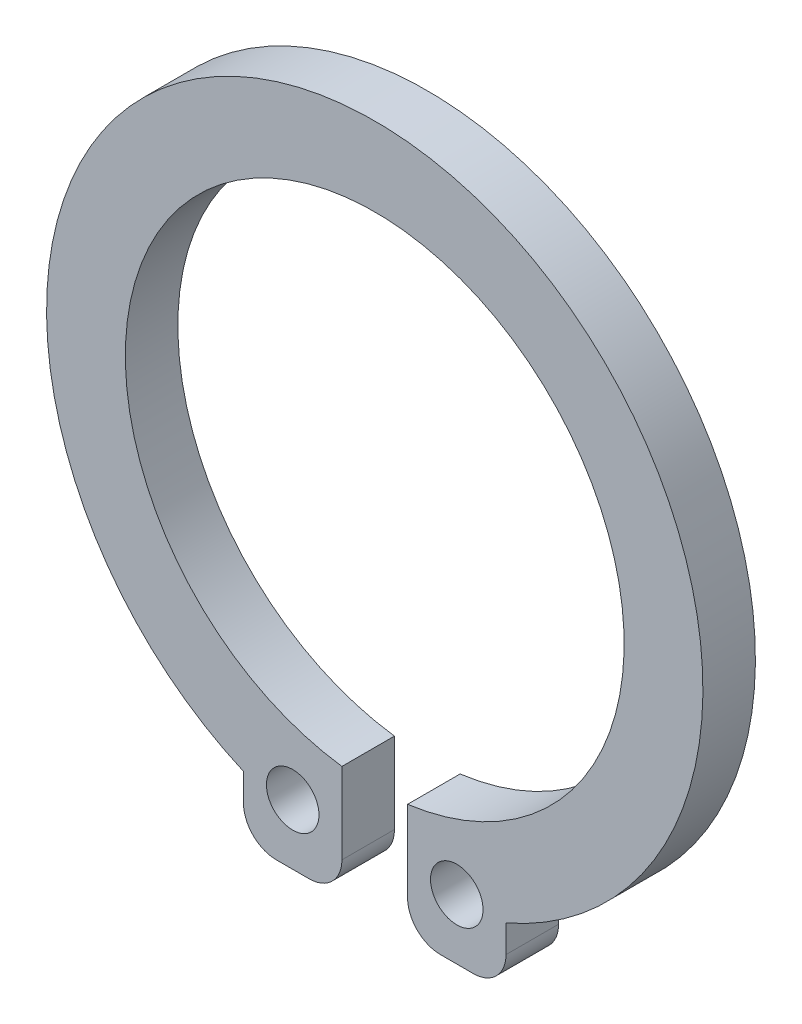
from build123d import *

# Parameters (mm, degrees)
ESQUISSE1_R      = 0.4
EXTRUSION1_DEPTH = 0.8


with BuildPart() as part:
    # Esquisse1 → Extrusion1 (new body)
    with BuildSketch(Plane.XY):
        with BuildLine():
            Line((-0.5, -3.76696164), (-0.5, -5))
            ThreePointArc((-0.5, -5), (-0.646446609, -5.353553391), (-1, -5.5))
            Line((-1, -5.5), (-1.5, -5.5))
            ThreePointArc((-1.5, -5.5), (-1.853553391, -5.353553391), (-2, -5))
            Line((-2, -5), (-2, -4.582575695))
            ThreePointArc((-2, -4.582575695), (0, 5), (2, -4.582575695))
            Line((2, -4.582575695), (2, -5))
            ThreePointArc((2, -5), (1.853553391, -5.353553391), (1.5, -5.5))
            Line((1.5, -5.5), (1, -5.5))
            ThreePointArc((1, -5.5), (0.646446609, -5.353553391), (0.5, -5))
            Line((0.5, -5), (0.5, -3.76696164))
            ThreePointArc((0.5, -3.76696164), (0, 3.8), (-0.5, -3.76696164))
        make_face()
        with Locations((-1.25, -4.582575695)):
            Circle(ESQUISSE1_R, mode=Mode.SUBTRACT)
        with Locations(Location((1.25, -4.582575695, 0), (0, 0, 180))):
            Circle(ESQUISSE1_R, mode=Mode.SUBTRACT)
    extrude(amount=EXTRUSION1_DEPTH)


solid = part.part
